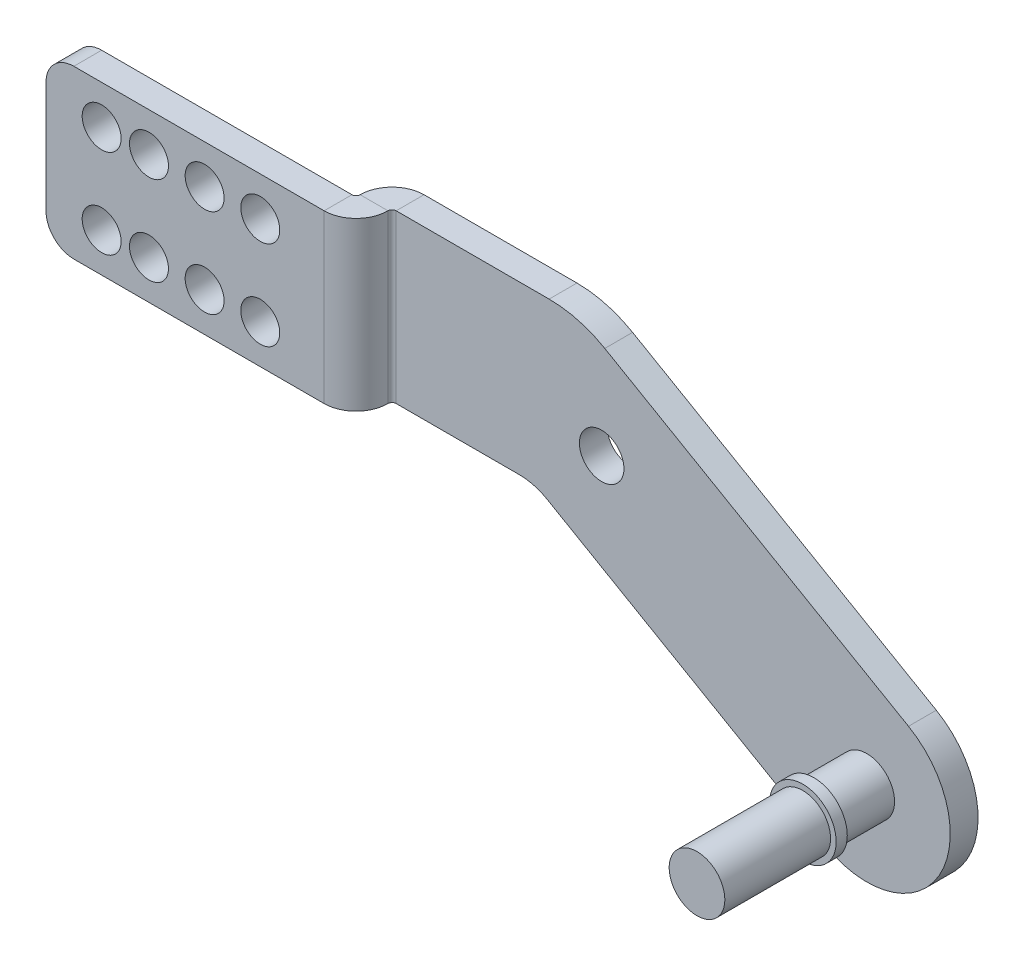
ISO-10303-21;
HEADER;
FILE_DESCRIPTION(('STEP AP214'),'2;1');
FILE_NAME('part.step','',(''),(''),'','','');
FILE_SCHEMA(('AUTOMOTIVE_DESIGN { 1 0 10303 214 1 1 1 1 }'));
ENDSEC;
DATA;
#1=APPLICATION_CONTEXT('core data for automotive mechanical design processes');
#2=APPLICATION_PROTOCOL_DEFINITION('international standard','automotive_design',2000,#1);
#3=PRODUCT_CONTEXT('',#1,'mechanical');
#4=PRODUCT('Part','Part','',(#3));
#5=PRODUCT_RELATED_PRODUCT_CATEGORY('part','',(#4));
#6=PRODUCT_DEFINITION_FORMATION('','',#4);
#7=PRODUCT_DEFINITION_CONTEXT('part definition',#1,'design');
#8=PRODUCT_DEFINITION('design','',#6,#7);
#9=PRODUCT_DEFINITION_SHAPE('','',#8);
#10=(LENGTH_UNIT() NAMED_UNIT(*) SI_UNIT(.MILLI.,.METRE.));
#11=(NAMED_UNIT(*) PLANE_ANGLE_UNIT() SI_UNIT($,.RADIAN.));
#12=(NAMED_UNIT(*) SI_UNIT($,.STERADIAN.) SOLID_ANGLE_UNIT());
#13=UNCERTAINTY_MEASURE_WITH_UNIT(LENGTH_MEASURE(1.E-05),#10,'distance_accuracy_value','');
#14=(GEOMETRIC_REPRESENTATION_CONTEXT(3) GLOBAL_UNCERTAINTY_ASSIGNED_CONTEXT((#13)) GLOBAL_UNIT_ASSIGNED_CONTEXT((#10,
#11,#12)) REPRESENTATION_CONTEXT('',''));
#15=CARTESIAN_POINT('',(0.,0.,0.));
#16=DIRECTION('',(0.,0.,1.));
#17=DIRECTION('',(1.,0.,0.));
#18=AXIS2_PLACEMENT_3D('',#15,#16,#17);
#19=CARTESIAN_POINT('',(1076.1484565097,382.762408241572,5.));
#20=DIRECTION('',(0.,-1.,0.));
#21=DIRECTION('',(1.,0.,0.));
#22=AXIS2_PLACEMENT_3D('',#19,#20,#21);
#23=PLANE('',#22);
#24=DIRECTION('',(-1.,0.,0.));
#25=VECTOR('',#24,1.);
#26=CARTESIAN_POINT('',(1076.1484565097,382.762408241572,0.));
#27=LINE('',#26,#25);
#28=CARTESIAN_POINT('',(1076.1484565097,382.762408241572,0.));
#29=VERTEX_POINT('',#28);
#30=CARTESIAN_POINT('',(1048.67009661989,382.762408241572,7.34061774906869E-07));
#31=VERTEX_POINT('',#30);
#32=EDGE_CURVE('E288',#29,#31,#27,.T.);
#33=ORIENTED_EDGE('',*,*,#32,.T.);
#34=DIRECTION('',(0.,0.,1.));
#35=VECTOR('',#34,1.);
#36=CARTESIAN_POINT('',(1048.67009661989,382.762408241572,5.));
#37=LINE('',#36,#35);
#38=CARTESIAN_POINT('',(1048.67009661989,382.762408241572,5.00000073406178));
#39=VERTEX_POINT('',#38);
#40=EDGE_CURVE('E321',#31,#39,#37,.T.);
#41=ORIENTED_EDGE('',*,*,#40,.T.);
#42=DIRECTION('',(-1.,0.,0.));
#43=VECTOR('',#42,1.);
#44=CARTESIAN_POINT('',(1076.1484565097,382.762408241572,5.));
#45=LINE('',#44,#43);
#46=CARTESIAN_POINT('',(1076.1484565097,382.762408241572,5.));
#47=VERTEX_POINT('',#46);
#48=EDGE_CURVE('E300',#47,#39,#45,.T.);
#49=ORIENTED_EDGE('',*,*,#48,.F.);
#50=DIRECTION('',(0.,0.,-1.));
#51=VECTOR('',#50,1.);
#52=CARTESIAN_POINT('',(1076.1484565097,382.762408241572,5.));
#53=LINE('',#52,#51);
#54=EDGE_CURVE('E301',#47,#29,#53,.T.);
#55=ORIENTED_EDGE('',*,*,#54,.T.);
#56=EDGE_LOOP('',(#33,#41,#49,#55));
#57=FACE_BOUND('',#56,.T.);
#58=ADVANCED_FACE('F16',(#57),#23,.F.);
#59=CARTESIAN_POINT('',(997.221036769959,352.762408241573,5.));
#60=DIRECTION('',(0.,1.,0.));
#61=DIRECTION('',(0.,0.,1.));
#62=AXIS2_PLACEMENT_3D('',#59,#60,#61);
#63=PLANE('',#62);
#64=DIRECTION('',(1.,0.,0.));
#65=VECTOR('',#64,1.);
#66=CARTESIAN_POINT('',(997.221036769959,352.762408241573,5.));
#67=LINE('',#66,#65);
#68=CARTESIAN_POINT('',(1048.67009661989,352.762408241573,5.00000036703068));
#69=VERTEX_POINT('',#68);
#70=CARTESIAN_POINT('',(1070.78947266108,352.762408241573,5.));
#71=VERTEX_POINT('',#70);
#72=EDGE_CURVE('E292',#69,#71,#67,.T.);
#73=ORIENTED_EDGE('',*,*,#72,.F.);
#74=DIRECTION('',(0.,0.,-1.));
#75=VECTOR('',#74,1.);
#76=CARTESIAN_POINT('',(1048.67009661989,352.762408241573,5.));
#77=LINE('',#76,#75);
#78=CARTESIAN_POINT('',(1048.67009661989,352.762408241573,0.));
#79=VERTEX_POINT('',#78);
#80=EDGE_CURVE('E327',#69,#79,#77,.T.);
#81=ORIENTED_EDGE('',*,*,#80,.T.);
#82=DIRECTION('',(1.,0.,0.));
#83=VECTOR('',#82,1.);
#84=CARTESIAN_POINT('',(997.221036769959,352.762408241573,0.));
#85=LINE('',#84,#83);
#86=CARTESIAN_POINT('',(1070.78947266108,352.762408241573,0.));
#87=VERTEX_POINT('',#86);
#88=EDGE_CURVE('E277',#79,#87,#85,.T.);
#89=ORIENTED_EDGE('',*,*,#88,.T.);
#90=DIRECTION('',(0.,0.,-1.));
#91=VECTOR('',#90,1.);
#92=CARTESIAN_POINT('',(1070.78947266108,352.762408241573,5.));
#93=LINE('',#92,#91);
#94=EDGE_CURVE('E316',#71,#87,#93,.T.);
#95=ORIENTED_EDGE('',*,*,#94,.F.);
#96=EDGE_LOOP('',(#73,#81,#89,#95));
#97=FACE_BOUND('',#96,.T.);
#98=ADVANCED_FACE('F365',(#97),#63,.F.);
#99=CARTESIAN_POINT('',(997.221036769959,357.762408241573,0.));
#100=DIRECTION('',(0.,0.,1.));
#101=DIRECTION('',(1.,0.,0.));
#102=AXIS2_PLACEMENT_3D('',#99,#100,#101);
#103=PLANE('',#102);
#104=CARTESIAN_POINT('',(1085.58963956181,363.085041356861,0.));
#105=DIRECTION('',(0.,0.,1.));
#106=DIRECTION('',(1.,0.,0.));
#107=AXIS2_PLACEMENT_3D('',#104,#105,#106);
#108=CIRCLE('',#107,4.);
#109=CARTESIAN_POINT('',(1089.58963956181,363.085041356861,0.));
#110=VERTEX_POINT('',#109);
#111=EDGE_CURVE('E271',#110,#110,#108,.T.);
#112=ORIENTED_EDGE('',*,*,#111,.T.);
#113=EDGE_LOOP('',(#112));
#114=FACE_BOUND('',#113,.T.);
#115=ORIENTED_EDGE('',*,*,#88,.F.);
#116=DIRECTION('',(0.,1.,0.));
#117=VECTOR('',#116,1.);
#118=CARTESIAN_POINT('',(1048.67009661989,357.762408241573,0.));
#119=LINE('',#118,#117);
#120=EDGE_CURVE('E324',#79,#31,#119,.T.);
#121=ORIENTED_EDGE('',*,*,#120,.T.);
#122=ORIENTED_EDGE('',*,*,#32,.F.);
#123=CARTESIAN_POINT('',(1076.1484565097,362.762408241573,0.));
#124=DIRECTION('',(0.,0.,1.));
#125=DIRECTION('',(1.,0.,0.));
#126=AXIS2_PLACEMENT_3D('',#123,#124,#125);
#127=CIRCLE('',#126,20.);
#128=CARTESIAN_POINT('',(1086.1484565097,380.082916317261,0.));
#129=VERTEX_POINT('',#128);
#130=EDGE_CURVE('E286',#129,#29,#127,.T.);
#131=ORIENTED_EDGE('',*,*,#130,.F.);
#132=DIRECTION('',(-0.866025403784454,0.499999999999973,0.));
#133=VECTOR('',#132,1.);
#134=CARTESIAN_POINT('',(1140.72103676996,348.575422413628,0.));
#135=LINE('',#134,#133);
#136=CARTESIAN_POINT('',(1140.72103676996,348.575422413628,0.));
#137=VERTEX_POINT('',#136);
#138=EDGE_CURVE('E284',#137,#129,#135,.T.);
#139=ORIENTED_EDGE('',*,*,#138,.F.);
#140=CARTESIAN_POINT('',(1133.22103676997,335.58504135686,0.));
#141=DIRECTION('',(0.,0.,1.));
#142=DIRECTION('',(1.,0.,0.));
#143=AXIS2_PLACEMENT_3D('',#140,#141,#142);
#144=CIRCLE('',#143,14.999999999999);
#145=CARTESIAN_POINT('',(1125.72103676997,322.594660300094,0.));
#146=VERTEX_POINT('',#145);
#147=EDGE_CURVE('E282',#146,#137,#144,.T.);
#148=ORIENTED_EDGE('',*,*,#147,.F.);
#149=DIRECTION('',(0.866025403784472,-0.499999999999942,0.));
#150=VECTOR('',#149,1.);
#151=CARTESIAN_POINT('',(1075.78947266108,351.422662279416,0.));
#152=LINE('',#151,#150);
#153=CARTESIAN_POINT('',(1075.78947266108,351.422662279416,0.));
#154=VERTEX_POINT('',#153);
#155=EDGE_CURVE('E280',#154,#146,#152,.T.);
#156=ORIENTED_EDGE('',*,*,#155,.F.);
#157=CARTESIAN_POINT('',(1070.78947266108,342.762408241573,0.));
#158=DIRECTION('',(0.,0.,-1.));
#159=DIRECTION('',(1.,0.,0.));
#160=AXIS2_PLACEMENT_3D('',#157,#158,#159);
#161=CIRCLE('',#160,10.);
#162=EDGE_CURVE('E278',#87,#154,#161,.T.);
#163=ORIENTED_EDGE('',*,*,#162,.F.);
#164=EDGE_LOOP('',(#115,#121,#122,#131,#139,#148,#156,#163));
#165=FACE_BOUND('',#164,.T.);
#166=ADVANCED_FACE('F359',(#114,#165),#103,.F.);
#167=CARTESIAN_POINT('',(1133.22103676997,335.58504135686,16.5));
#168=DIRECTION('',(0.,0.,1.));
#169=DIRECTION('',(1.,0.,0.));
#170=AXIS2_PLACEMENT_3D('',#167,#168,#169);
#171=PLANE('',#170);
#172=CARTESIAN_POINT('',(1133.22103676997,335.58504135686,16.5));
#173=DIRECTION('',(0.,0.,1.));
#174=DIRECTION('',(1.,0.,0.));
#175=AXIS2_PLACEMENT_3D('',#172,#173,#174);
#176=CIRCLE('',#175,5.99999999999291);
#177=CARTESIAN_POINT('',(1139.22103676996,335.58504135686,16.5));
#178=VERTEX_POINT('',#177);
#179=EDGE_CURVE('E262',#178,#178,#176,.T.);
#180=ORIENTED_EDGE('',*,*,#179,.T.);
#181=EDGE_LOOP('',(#180));
#182=FACE_BOUND('',#181,.T.);
#183=CARTESIAN_POINT('',(1133.22103676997,335.58504135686,16.5));
#184=DIRECTION('',(0.,0.,1.));
#185=DIRECTION('',(1.,0.,0.));
#186=AXIS2_PLACEMENT_3D('',#183,#184,#185);
#187=CIRCLE('',#186,4.99999999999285);
#188=CARTESIAN_POINT('',(1138.22103676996,335.58504135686,16.5));
#189=VERTEX_POINT('',#188);
#190=EDGE_CURVE('E253',#189,#189,#187,.T.);
#191=ORIENTED_EDGE('',*,*,#190,.F.);
#192=EDGE_LOOP('',(#191));
#193=FACE_BOUND('',#192,.T.);
#194=ADVANCED_FACE('F403',(#182,#193),#171,.T.);
#195=CARTESIAN_POINT('',(997.221036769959,357.762408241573,5.));
#196=DIRECTION('',(0.,0.,1.));
#197=DIRECTION('',(1.,0.,0.));
#198=AXIS2_PLACEMENT_3D('',#195,#196,#197);
#199=PLANE('',#198);
#200=DIRECTION('',(0.,1.,0.));
#201=VECTOR('',#200,1.);
#202=CARTESIAN_POINT('',(1048.67009661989,357.762408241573,5.));
#203=LINE('',#202,#201);
#204=EDGE_CURVE('E319',#69,#39,#203,.T.);
#205=ORIENTED_EDGE('',*,*,#204,.F.);
#206=ORIENTED_EDGE('',*,*,#72,.T.);
#207=CARTESIAN_POINT('',(1070.78947266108,342.762408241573,5.));
#208=DIRECTION('',(0.,0.,-1.));
#209=DIRECTION('',(1.,0.,0.));
#210=AXIS2_PLACEMENT_3D('',#207,#208,#209);
#211=CIRCLE('',#210,10.);
#212=CARTESIAN_POINT('',(1075.78947266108,351.422662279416,5.));
#213=VERTEX_POINT('',#212);
#214=EDGE_CURVE('E289',#71,#213,#211,.T.);
#215=ORIENTED_EDGE('',*,*,#214,.T.);
#216=DIRECTION('',(0.866025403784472,-0.499999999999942,0.));
#217=VECTOR('',#216,1.);
#218=CARTESIAN_POINT('',(1075.78947266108,351.422662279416,5.));
#219=LINE('',#218,#217);
#220=CARTESIAN_POINT('',(1125.72103676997,322.594660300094,5.));
#221=VERTEX_POINT('',#220);
#222=EDGE_CURVE('E291',#213,#221,#219,.T.);
#223=ORIENTED_EDGE('',*,*,#222,.T.);
#224=CARTESIAN_POINT('',(1133.22103676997,335.58504135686,5.));
#225=DIRECTION('',(0.,0.,1.));
#226=DIRECTION('',(1.,0.,0.));
#227=AXIS2_PLACEMENT_3D('',#224,#225,#226);
#228=CIRCLE('',#227,14.999999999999);
#229=CARTESIAN_POINT('',(1140.72103676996,348.575422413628,5.));
#230=VERTEX_POINT('',#229);
#231=EDGE_CURVE('E294',#221,#230,#228,.T.);
#232=ORIENTED_EDGE('',*,*,#231,.T.);
#233=DIRECTION('',(-0.866025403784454,0.499999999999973,0.));
#234=VECTOR('',#233,1.);
#235=CARTESIAN_POINT('',(1140.72103676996,348.575422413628,5.));
#236=LINE('',#235,#234);
#237=CARTESIAN_POINT('',(1086.1484565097,380.082916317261,5.));
#238=VERTEX_POINT('',#237);
#239=EDGE_CURVE('E296',#230,#238,#236,.T.);
#240=ORIENTED_EDGE('',*,*,#239,.T.);
#241=CARTESIAN_POINT('',(1076.1484565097,362.762408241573,5.));
#242=DIRECTION('',(0.,0.,1.));
#243=DIRECTION('',(1.,0.,0.));
#244=AXIS2_PLACEMENT_3D('',#241,#242,#243);
#245=CIRCLE('',#244,20.);
#246=EDGE_CURVE('E298',#238,#47,#245,.T.);
#247=ORIENTED_EDGE('',*,*,#246,.T.);
#248=ORIENTED_EDGE('',*,*,#48,.T.);
#249=EDGE_LOOP('',(#205,#206,#215,#223,#232,#240,#247,#248));
#250=FACE_BOUND('',#249,.T.);
#251=CARTESIAN_POINT('',(1085.58963956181,363.085041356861,5.));
#252=DIRECTION('',(0.,0.,1.));
#253=DIRECTION('',(1.,0.,0.));
#254=AXIS2_PLACEMENT_3D('',#251,#252,#253);
#255=CIRCLE('',#254,4.);
#256=CARTESIAN_POINT('',(1089.58963956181,363.085041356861,5.));
#257=VERTEX_POINT('',#256);
#258=EDGE_CURVE('E274',#257,#257,#255,.T.);
#259=ORIENTED_EDGE('',*,*,#258,.F.);
#260=EDGE_LOOP('',(#259));
#261=FACE_BOUND('',#260,.T.);
#262=CARTESIAN_POINT('',(1133.22103676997,335.58504135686,5.));
#263=DIRECTION('',(0.,0.,1.));
#264=DIRECTION('',(1.,0.,0.));
#265=AXIS2_PLACEMENT_3D('',#262,#263,#264);
#266=CIRCLE('',#265,4.99999999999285);
#267=CARTESIAN_POINT('',(1138.22103676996,335.58504135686,5.));
#268=VERTEX_POINT('',#267);
#269=EDGE_CURVE('E265',#268,#268,#266,.T.);
#270=ORIENTED_EDGE('',*,*,#269,.F.);
#271=EDGE_LOOP('',(#270));
#272=FACE_BOUND('',#271,.T.);
#273=ADVANCED_FACE('F18',(#250,#261,#272),#199,.T.);
#274=CARTESIAN_POINT('',(1070.78947266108,342.762408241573,5.));
#275=DIRECTION('',(0.,0.,-1.));
#276=DIRECTION('',(-1.,0.,0.));
#277=AXIS2_PLACEMENT_3D('',#274,#275,#276);
#278=CYLINDRICAL_SURFACE('',#277,10.);
#279=ORIENTED_EDGE('',*,*,#162,.T.);
#280=DIRECTION('',(0.,0.,-1.));
#281=VECTOR('',#280,1.);
#282=CARTESIAN_POINT('',(1075.78947266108,351.422662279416,5.));
#283=LINE('',#282,#281);
#284=EDGE_CURVE('E313',#213,#154,#283,.T.);
#285=ORIENTED_EDGE('',*,*,#284,.F.);
#286=ORIENTED_EDGE('',*,*,#214,.F.);
#287=ORIENTED_EDGE('',*,*,#94,.T.);
#288=EDGE_LOOP('',(#279,#285,#286,#287));
#289=FACE_BOUND('',#288,.T.);
#290=ADVANCED_FACE('F394',(#289),#278,.F.);
#291=CARTESIAN_POINT('',(1075.78947266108,351.422662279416,5.));
#292=DIRECTION('',(0.499999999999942,0.866025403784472,0.));
#293=DIRECTION('',(-0.866025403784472,0.499999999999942,0.));
#294=AXIS2_PLACEMENT_3D('',#291,#292,#293);
#295=PLANE('',#294);
#296=ORIENTED_EDGE('',*,*,#155,.T.);
#297=DIRECTION('',(0.,0.,-1.));
#298=VECTOR('',#297,1.);
#299=CARTESIAN_POINT('',(1125.72103676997,322.594660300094,5.));
#300=LINE('',#299,#298);
#301=EDGE_CURVE('E310',#221,#146,#300,.T.);
#302=ORIENTED_EDGE('',*,*,#301,.F.);
#303=ORIENTED_EDGE('',*,*,#222,.F.);
#304=ORIENTED_EDGE('',*,*,#284,.T.);
#305=EDGE_LOOP('',(#296,#302,#303,#304));
#306=FACE_BOUND('',#305,.T.);
#307=ADVANCED_FACE('F390',(#306),#295,.F.);
#308=CARTESIAN_POINT('',(1133.22103676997,335.58504135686,5.));
#309=DIRECTION('',(0.,0.,-1.));
#310=DIRECTION('',(-1.,0.,0.));
#311=AXIS2_PLACEMENT_3D('',#308,#309,#310);
#312=CYLINDRICAL_SURFACE('',#311,14.999999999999);
#313=ORIENTED_EDGE('',*,*,#147,.T.);
#314=DIRECTION('',(0.,0.,-1.));
#315=VECTOR('',#314,1.);
#316=CARTESIAN_POINT('',(1140.72103676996,348.575422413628,5.));
#317=LINE('',#316,#315);
#318=EDGE_CURVE('E307',#230,#137,#317,.T.);
#319=ORIENTED_EDGE('',*,*,#318,.F.);
#320=ORIENTED_EDGE('',*,*,#231,.F.);
#321=ORIENTED_EDGE('',*,*,#301,.T.);
#322=EDGE_LOOP('',(#313,#319,#320,#321));
#323=FACE_BOUND('',#322,.T.);
#324=ADVANCED_FACE('F386',(#323),#312,.T.);
#325=CARTESIAN_POINT('',(1140.72103676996,348.575422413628,5.));
#326=DIRECTION('',(-0.499999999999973,-0.866025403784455,0.));
#327=DIRECTION('',(0.866025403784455,-0.499999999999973,0.));
#328=AXIS2_PLACEMENT_3D('',#325,#326,#327);
#329=PLANE('',#328);
#330=ORIENTED_EDGE('',*,*,#138,.T.);
#331=DIRECTION('',(0.,0.,-1.));
#332=VECTOR('',#331,1.);
#333=CARTESIAN_POINT('',(1086.1484565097,380.082916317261,5.));
#334=LINE('',#333,#332);
#335=EDGE_CURVE('E304',#238,#129,#334,.T.);
#336=ORIENTED_EDGE('',*,*,#335,.F.);
#337=ORIENTED_EDGE('',*,*,#239,.F.);
#338=ORIENTED_EDGE('',*,*,#318,.T.);
#339=EDGE_LOOP('',(#330,#336,#337,#338));
#340=FACE_BOUND('',#339,.T.);
#341=ADVANCED_FACE('F382',(#340),#329,.F.);
#342=CARTESIAN_POINT('',(1076.1484565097,362.762408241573,5.));
#343=DIRECTION('',(0.,0.,-1.));
#344=DIRECTION('',(-1.,0.,0.));
#345=AXIS2_PLACEMENT_3D('',#342,#343,#344);
#346=CYLINDRICAL_SURFACE('',#345,20.);
#347=ORIENTED_EDGE('',*,*,#130,.T.);
#348=ORIENTED_EDGE('',*,*,#54,.F.);
#349=ORIENTED_EDGE('',*,*,#246,.F.);
#350=ORIENTED_EDGE('',*,*,#335,.T.);
#351=EDGE_LOOP('',(#347,#348,#349,#350));
#352=FACE_BOUND('',#351,.T.);
#353=ADVANCED_FACE('F378',(#352),#346,.T.);
#354=CARTESIAN_POINT('',(1085.58963956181,363.085041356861,5.));
#355=DIRECTION('',(0.,0.,-1.));
#356=DIRECTION('',(-1.,0.,0.));
#357=AXIS2_PLACEMENT_3D('',#354,#355,#356);
#358=CYLINDRICAL_SURFACE('',#357,4.);
#359=ORIENTED_EDGE('',*,*,#258,.T.);
#360=EDGE_LOOP('',(#359));
#361=FACE_BOUND('',#360,.T.);
#362=ORIENTED_EDGE('',*,*,#111,.F.);
#363=EDGE_LOOP('',(#362));
#364=FACE_BOUND('',#363,.T.);
#365=ADVANCED_FACE('F419',(#361,#364),#358,.F.);
#366=CARTESIAN_POINT('',(1133.22103676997,335.58504135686,14.5));
#367=DIRECTION('',(0.,0.,-1.));
#368=DIRECTION('',(-1.,0.,0.));
#369=AXIS2_PLACEMENT_3D('',#366,#367,#368);
#370=CYLINDRICAL_SURFACE('',#369,4.99999999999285);
#371=CARTESIAN_POINT('',(1133.22103676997,335.58504135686,14.5));
#372=DIRECTION('',(0.,0.,1.));
#373=DIRECTION('',(1.,0.,0.));
#374=AXIS2_PLACEMENT_3D('',#371,#372,#373);
#375=CIRCLE('',#374,4.99999999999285);
#376=CARTESIAN_POINT('',(1138.22103676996,335.58504135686,14.5));
#377=VERTEX_POINT('',#376);
#378=EDGE_CURVE('E268',#377,#377,#375,.T.);
#379=ORIENTED_EDGE('',*,*,#378,.F.);
#380=EDGE_LOOP('',(#379));
#381=FACE_BOUND('',#380,.T.);
#382=ORIENTED_EDGE('',*,*,#269,.T.);
#383=EDGE_LOOP('',(#382));
#384=FACE_BOUND('',#383,.T.);
#385=ADVANCED_FACE('F421',(#381,#384),#370,.T.);
#386=CARTESIAN_POINT('',(1133.22103676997,335.58504135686,14.5));
#387=DIRECTION('',(0.,0.,1.));
#388=DIRECTION('',(1.,0.,0.));
#389=AXIS2_PLACEMENT_3D('',#386,#387,#388);
#390=PLANE('',#389);
#391=CARTESIAN_POINT('',(1133.22103676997,335.58504135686,14.5));
#392=DIRECTION('',(0.,0.,1.));
#393=DIRECTION('',(1.,0.,0.));
#394=AXIS2_PLACEMENT_3D('',#391,#392,#393);
#395=CIRCLE('',#394,5.99999999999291);
#396=CARTESIAN_POINT('',(1139.22103676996,335.58504135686,14.5));
#397=VERTEX_POINT('',#396);
#398=EDGE_CURVE('E259',#397,#397,#395,.T.);
#399=ORIENTED_EDGE('',*,*,#398,.F.);
#400=EDGE_LOOP('',(#399));
#401=FACE_BOUND('',#400,.T.);
#402=ORIENTED_EDGE('',*,*,#378,.T.);
#403=EDGE_LOOP('',(#402));
#404=FACE_BOUND('',#403,.T.);
#405=ADVANCED_FACE('F428',(#401,#404),#390,.F.);
#406=CARTESIAN_POINT('',(1133.22103676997,335.58504135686,16.5));
#407=DIRECTION('',(0.,0.,-1.));
#408=DIRECTION('',(-1.,0.,0.));
#409=AXIS2_PLACEMENT_3D('',#406,#407,#408);
#410=CYLINDRICAL_SURFACE('',#409,5.99999999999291);
#411=ORIENTED_EDGE('',*,*,#179,.F.);
#412=EDGE_LOOP('',(#411));
#413=FACE_BOUND('',#412,.T.);
#414=ORIENTED_EDGE('',*,*,#398,.T.);
#415=EDGE_LOOP('',(#414));
#416=FACE_BOUND('',#415,.T.);
#417=ADVANCED_FACE('F477',(#413,#416),#410,.T.);
#418=CARTESIAN_POINT('',(1133.22103676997,335.58504135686,35.5));
#419=DIRECTION('',(0.,0.,-1.));
#420=DIRECTION('',(-1.,0.,0.));
#421=AXIS2_PLACEMENT_3D('',#418,#419,#420);
#422=CYLINDRICAL_SURFACE('',#421,4.99999999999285);
#423=CARTESIAN_POINT('',(1133.22103676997,335.58504135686,35.5));
#424=DIRECTION('',(0.,0.,1.));
#425=DIRECTION('',(1.,0.,0.));
#426=AXIS2_PLACEMENT_3D('',#423,#424,#425);
#427=CIRCLE('',#426,4.99999999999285);
#428=CARTESIAN_POINT('',(1138.22103676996,335.58504135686,35.5));
#429=VERTEX_POINT('',#428);
#430=EDGE_CURVE('E256',#429,#429,#427,.T.);
#431=ORIENTED_EDGE('',*,*,#430,.F.);
#432=EDGE_LOOP('',(#431));
#433=FACE_BOUND('',#432,.T.);
#434=ORIENTED_EDGE('',*,*,#190,.T.);
#435=EDGE_LOOP('',(#434));
#436=FACE_BOUND('',#435,.T.);
#437=ADVANCED_FACE('F488',(#433,#436),#422,.T.);
#438=CARTESIAN_POINT('',(1133.22103676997,335.58504135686,35.5));
#439=DIRECTION('',(0.,0.,1.));
#440=DIRECTION('',(1.,0.,0.));
#441=AXIS2_PLACEMENT_3D('',#438,#439,#440);
#442=PLANE('',#441);
#443=ORIENTED_EDGE('',*,*,#430,.T.);
#444=EDGE_LOOP('',(#443));
#445=FACE_BOUND('',#444,.T.);
#446=ADVANCED_FACE('F498',(#445),#442,.T.);
#447=CARTESIAN_POINT('',(1048.67009661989,352.762408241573,5.73659926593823));
#448=DIRECTION('',(0.,1.,0.));
#449=DIRECTION('',(0.,0.,1.));
#450=AXIS2_PLACEMENT_3D('',#447,#448,#449);
#451=PLANE('',#450);
#452=DIRECTION('',(-1.,0.,0.));
#453=VECTOR('',#452,1.);
#454=CARTESIAN_POINT('',(1047.93349661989,352.762408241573,5.73660000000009));
#455=LINE('',#454,#453);
#456=CARTESIAN_POINT('',(1047.9334966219,352.762408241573,5.7366));
#457=VERTEX_POINT('',#456);
#458=CARTESIAN_POINT('',(1042.93349661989,352.762408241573,5.73660000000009));
#459=VERTEX_POINT('',#458);
#460=EDGE_CURVE('E11',#457,#459,#455,.T.);
#461=ORIENTED_EDGE('',*,*,#460,.T.);
#462=CARTESIAN_POINT('',(1048.67009661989,352.762408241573,5.7366));
#463=DIRECTION('',(0.,-1.,0.));
#464=DIRECTION('',(0.,0.,-1.));
#465=AXIS2_PLACEMENT_3D('',#462,#463,#464);
#466=CIRCLE('',#465,5.73659926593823);
#467=EDGE_CURVE('E38',#459,#79,#466,.T.);
#468=ORIENTED_EDGE('',*,*,#467,.T.);
#469=ORIENTED_EDGE('',*,*,#80,.F.);
#470=CARTESIAN_POINT('',(1048.67009661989,352.762408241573,5.73659926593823));
#471=DIRECTION('',(0.,-1.,0.));
#472=DIRECTION('',(0.,0.,-1.));
#473=AXIS2_PLACEMENT_3D('',#470,#471,#472);
#474=CIRCLE('',#473,0.736598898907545);
#475=EDGE_CURVE('E247',#457,#69,#474,.T.);
#476=ORIENTED_EDGE('',*,*,#475,.F.);
#477=EDGE_LOOP('',(#461,#468,#469,#476));
#478=FACE_BOUND('',#477,.T.);
#479=ADVANCED_FACE('F367',(#478),#451,.F.);
#480=CARTESIAN_POINT('',(1048.67009661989,382.762408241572,5.73659926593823));
#481=DIRECTION('',(0.,-1.,0.));
#482=DIRECTION('',(0.,0.,-1.));
#483=AXIS2_PLACEMENT_3D('',#480,#481,#482);
#484=PLANE('',#483);
#485=CARTESIAN_POINT('',(1048.67009661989,382.762408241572,5.7366));
#486=DIRECTION('',(0.,-1.,0.));
#487=DIRECTION('',(0.,0.,-1.));
#488=AXIS2_PLACEMENT_3D('',#485,#486,#487);
#489=CIRCLE('',#488,5.73659926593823);
#490=CARTESIAN_POINT('',(1042.93349662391,382.762408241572,5.73660000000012));
#491=VERTEX_POINT('',#490);
#492=EDGE_CURVE('E244',#31,#491,#489,.F.);
#493=ORIENTED_EDGE('',*,*,#492,.T.);
#494=DIRECTION('',(1.,0.,0.));
#495=VECTOR('',#494,1.);
#496=CARTESIAN_POINT('',(1047.93349661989,382.762408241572,5.73660000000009));
#497=LINE('',#496,#495);
#498=CARTESIAN_POINT('',(1047.93349662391,382.762408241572,5.73660000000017));
#499=VERTEX_POINT('',#498);
#500=EDGE_CURVE('E338',#491,#499,#497,.T.);
#501=ORIENTED_EDGE('',*,*,#500,.T.);
#502=CARTESIAN_POINT('',(1048.67009661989,382.762408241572,5.73659926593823));
#503=DIRECTION('',(0.,1.,0.));
#504=DIRECTION('',(0.,0.,1.));
#505=AXIS2_PLACEMENT_3D('',#502,#503,#504);
#506=CIRCLE('',#505,0.736598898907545);
#507=EDGE_CURVE('E250',#39,#499,#506,.T.);
#508=ORIENTED_EDGE('',*,*,#507,.F.);
#509=ORIENTED_EDGE('',*,*,#40,.F.);
#510=EDGE_LOOP('',(#493,#501,#508,#509));
#511=FACE_BOUND('',#510,.T.);
#512=ADVANCED_FACE('F350',(#511),#484,.F.);
#513=CARTESIAN_POINT('',(1048.67009661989,398.598222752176,5.7366));
#514=DIRECTION('',(0.,-1.,0.));
#515=DIRECTION('',(0.,0.,-1.));
#516=AXIS2_PLACEMENT_3D('',#513,#514,#515);
#517=CYLINDRICAL_SURFACE('',#516,0.736599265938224);
#518=ORIENTED_EDGE('',*,*,#204,.T.);
#519=ORIENTED_EDGE('',*,*,#507,.T.);
#520=DIRECTION('',(0.,1.,0.));
#521=VECTOR('',#520,1.);
#522=CARTESIAN_POINT('',(1047.93349661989,357.762408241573,5.73660000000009));
#523=LINE('',#522,#521);
#524=EDGE_CURVE('E330',#457,#499,#523,.T.);
#525=ORIENTED_EDGE('',*,*,#524,.F.);
#526=ORIENTED_EDGE('',*,*,#475,.T.);
#527=EDGE_LOOP('',(#518,#519,#525,#526));
#528=FACE_BOUND('',#527,.T.);
#529=ADVANCED_FACE('F371',(#528),#517,.F.);
#530=CARTESIAN_POINT('',(1048.67009661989,398.598222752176,5.7366));
#531=DIRECTION('',(0.,-1.,0.));
#532=DIRECTION('',(0.,0.,-1.));
#533=AXIS2_PLACEMENT_3D('',#530,#531,#532);
#534=CYLINDRICAL_SURFACE('',#533,5.73659926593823);
#535=ORIENTED_EDGE('',*,*,#120,.F.);
#536=ORIENTED_EDGE('',*,*,#467,.F.);
#537=DIRECTION('',(0.,1.,0.));
#538=VECTOR('',#537,1.);
#539=CARTESIAN_POINT('',(1042.93349661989,357.762408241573,5.73660000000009));
#540=LINE('',#539,#538);
#541=EDGE_CURVE('E24',#459,#491,#540,.T.);
#542=ORIENTED_EDGE('',*,*,#541,.T.);
#543=ORIENTED_EDGE('',*,*,#492,.F.);
#544=EDGE_LOOP('',(#535,#536,#542,#543));
#545=FACE_BOUND('',#544,.T.);
#546=ADVANCED_FACE('F343',(#545),#534,.T.);
#547=CARTESIAN_POINT('',(1042.19689661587,352.762408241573,5.73660000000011));
#548=DIRECTION('',(0.,-1.,0.));
#549=DIRECTION('',(0.,0.,-1.));
#550=AXIS2_PLACEMENT_3D('',#547,#548,#549);
#551=PLANE('',#550);
#552=DIRECTION('',(0.,0.,-1.));
#553=VECTOR('',#552,1.);
#554=CARTESIAN_POINT('',(1042.19689661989,352.762408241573,11.4732));
#555=LINE('',#554,#553);
#556=CARTESIAN_POINT('',(1042.19689735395,352.762408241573,11.4732000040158));
#557=VERTEX_POINT('',#556);
#558=CARTESIAN_POINT('',(1042.19689661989,352.762408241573,6.47320000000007));
#559=VERTEX_POINT('',#558);
#560=EDGE_CURVE('E136',#557,#559,#555,.T.);
#561=ORIENTED_EDGE('',*,*,#560,.T.);
#562=CARTESIAN_POINT('',(1042.19689661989,352.762408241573,5.73660000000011));
#563=DIRECTION('',(0.,-1.,0.));
#564=DIRECTION('',(0.,0.,-1.));
#565=AXIS2_PLACEMENT_3D('',#562,#563,#564);
#566=CIRCLE('',#565,0.736600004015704);
#567=EDGE_CURVE('E31',#559,#459,#566,.F.);
#568=ORIENTED_EDGE('',*,*,#567,.T.);
#569=ORIENTED_EDGE('',*,*,#460,.F.);
#570=CARTESIAN_POINT('',(1042.19689661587,352.762408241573,5.73660000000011));
#571=DIRECTION('',(0.,1.,0.));
#572=DIRECTION('',(0.,0.,1.));
#573=AXIS2_PLACEMENT_3D('',#570,#571,#572);
#574=CIRCLE('',#573,5.73660000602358);
#575=EDGE_CURVE('E237',#557,#457,#574,.T.);
#576=ORIENTED_EDGE('',*,*,#575,.F.);
#577=EDGE_LOOP('',(#561,#568,#569,#576));
#578=FACE_BOUND('',#577,.T.);
#579=ADVANCED_FACE('F540',(#578),#551,.T.);
#580=CARTESIAN_POINT('',(1042.19689661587,382.762408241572,5.73660000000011));
#581=DIRECTION('',(0.,1.,0.));
#582=DIRECTION('',(0.,0.,1.));
#583=AXIS2_PLACEMENT_3D('',#580,#581,#582);
#584=PLANE('',#583);
#585=CARTESIAN_POINT('',(1042.19689661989,382.762408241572,5.73660000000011));
#586=DIRECTION('',(0.,-1.,0.));
#587=DIRECTION('',(0.,0.,-1.));
#588=AXIS2_PLACEMENT_3D('',#585,#586,#587);
#589=CIRCLE('',#588,0.736600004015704);
#590=CARTESIAN_POINT('',(1042.19689661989,382.762408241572,6.47320000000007));
#591=VERTEX_POINT('',#590);
#592=EDGE_CURVE('E234',#491,#591,#589,.T.);
#593=ORIENTED_EDGE('',*,*,#592,.T.);
#594=DIRECTION('',(0.,0.,1.));
#595=VECTOR('',#594,1.);
#596=CARTESIAN_POINT('',(1042.19689661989,382.762408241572,11.4732));
#597=LINE('',#596,#595);
#598=CARTESIAN_POINT('',(1042.19689661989,382.762408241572,11.4732));
#599=VERTEX_POINT('',#598);
#600=EDGE_CURVE('E226',#591,#599,#597,.T.);
#601=ORIENTED_EDGE('',*,*,#600,.T.);
#602=CARTESIAN_POINT('',(1042.19689661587,382.762408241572,5.73660000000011));
#603=DIRECTION('',(0.,-1.,0.));
#604=DIRECTION('',(0.,0.,-1.));
#605=AXIS2_PLACEMENT_3D('',#602,#603,#604);
#606=CIRCLE('',#605,5.73660000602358);
#607=EDGE_CURVE('E240',#499,#599,#606,.T.);
#608=ORIENTED_EDGE('',*,*,#607,.F.);
#609=ORIENTED_EDGE('',*,*,#500,.F.);
#610=EDGE_LOOP('',(#593,#601,#608,#609));
#611=FACE_BOUND('',#610,.T.);
#612=ADVANCED_FACE('F549',(#611),#584,.T.);
#613=CARTESIAN_POINT('',(1042.19689661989,398.598222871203,5.73660000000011));
#614=DIRECTION('',(0.,-1.,0.));
#615=DIRECTION('',(0.,0.,-1.));
#616=AXIS2_PLACEMENT_3D('',#613,#614,#615);
#617=CYLINDRICAL_SURFACE('',#616,5.7366000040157);
#618=ORIENTED_EDGE('',*,*,#524,.T.);
#619=ORIENTED_EDGE('',*,*,#607,.T.);
#620=DIRECTION('',(0.,1.,0.));
#621=VECTOR('',#620,1.);
#622=CARTESIAN_POINT('',(1042.19689661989,357.762408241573,11.4732));
#623=LINE('',#622,#621);
#624=EDGE_CURVE('E139',#557,#599,#623,.T.);
#625=ORIENTED_EDGE('',*,*,#624,.F.);
#626=ORIENTED_EDGE('',*,*,#575,.T.);
#627=EDGE_LOOP('',(#618,#619,#625,#626));
#628=FACE_BOUND('',#627,.T.);
#629=ADVANCED_FACE('F551',(#628),#617,.T.);
#630=CARTESIAN_POINT('',(1042.19689661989,398.598222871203,5.73660000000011));
#631=DIRECTION('',(0.,-1.,0.));
#632=DIRECTION('',(0.,0.,-1.));
#633=AXIS2_PLACEMENT_3D('',#630,#631,#632);
#634=CYLINDRICAL_SURFACE('',#633,0.736600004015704);
#635=ORIENTED_EDGE('',*,*,#541,.F.);
#636=ORIENTED_EDGE('',*,*,#567,.F.);
#637=DIRECTION('',(0.,1.,0.));
#638=VECTOR('',#637,1.);
#639=CARTESIAN_POINT('',(1042.19689661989,357.762408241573,6.47320000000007));
#640=LINE('',#639,#638);
#641=EDGE_CURVE('E229',#559,#591,#640,.T.);
#642=ORIENTED_EDGE('',*,*,#641,.T.);
#643=ORIENTED_EDGE('',*,*,#592,.F.);
#644=EDGE_LOOP('',(#635,#636,#642,#643));
#645=FACE_BOUND('',#644,.T.);
#646=ADVANCED_FACE('F346',(#645),#634,.F.);
#647=CARTESIAN_POINT('',(997.221036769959,357.762408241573,11.4732));
#648=DIRECTION('',(0.,0.,-1.));
#649=DIRECTION('',(-1.,0.,0.));
#650=AXIS2_PLACEMENT_3D('',#647,#648,#649);
#651=CYLINDRICAL_SURFACE('',#650,5.);
#652=CARTESIAN_POINT('',(997.221036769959,357.762408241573,6.47319999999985));
#653=DIRECTION('',(0.,0.,1.));
#654=DIRECTION('',(1.,0.,0.));
#655=AXIS2_PLACEMENT_3D('',#652,#653,#654);
#656=CIRCLE('',#655,5.);
#657=CARTESIAN_POINT('',(992.221036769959,357.762408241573,6.47319999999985));
#658=VERTEX_POINT('',#657);
#659=CARTESIAN_POINT('',(997.221036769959,352.762408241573,6.47319999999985));
#660=VERTEX_POINT('',#659);
#661=EDGE_CURVE('E154',#658,#660,#656,.T.);
#662=ORIENTED_EDGE('',*,*,#661,.T.);
#663=DIRECTION('',(0.,0.,-1.));
#664=VECTOR('',#663,1.);
#665=CARTESIAN_POINT('',(997.221036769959,352.762408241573,11.4732));
#666=LINE('',#665,#664);
#667=CARTESIAN_POINT('',(997.221036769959,352.762408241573,11.4732));
#668=VERTEX_POINT('',#667);
#669=EDGE_CURVE('E134',#668,#660,#666,.T.);
#670=ORIENTED_EDGE('',*,*,#669,.F.);
#671=CARTESIAN_POINT('',(997.221036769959,357.762408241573,11.4732));
#672=DIRECTION('',(0.,0.,1.));
#673=DIRECTION('',(1.,0.,0.));
#674=AXIS2_PLACEMENT_3D('',#671,#672,#673);
#675=CIRCLE('',#674,5.);
#676=CARTESIAN_POINT('',(992.221036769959,357.762408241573,11.4732));
#677=VERTEX_POINT('',#676);
#678=EDGE_CURVE('E143',#677,#668,#675,.T.);
#679=ORIENTED_EDGE('',*,*,#678,.F.);
#680=DIRECTION('',(0.,0.,-1.));
#681=VECTOR('',#680,1.);
#682=CARTESIAN_POINT('',(992.221036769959,357.762408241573,11.4732));
#683=LINE('',#682,#681);
#684=EDGE_CURVE('E223',#677,#658,#683,.T.);
#685=ORIENTED_EDGE('',*,*,#684,.T.);
#686=EDGE_LOOP('',(#662,#670,#679,#685));
#687=FACE_BOUND('',#686,.T.);
#688=ADVANCED_FACE('F152',(#687),#651,.T.);
#689=CARTESIAN_POINT('',(992.221036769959,377.762408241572,11.4732));
#690=DIRECTION('',(1.,0.,0.));
#691=DIRECTION('',(0.,0.,-1.));
#692=AXIS2_PLACEMENT_3D('',#689,#690,#691);
#693=PLANE('',#692);
#694=DIRECTION('',(0.,-1.,0.));
#695=VECTOR('',#694,1.);
#696=CARTESIAN_POINT('',(992.221036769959,377.762408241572,6.47319999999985));
#697=LINE('',#696,#695);
#698=CARTESIAN_POINT('',(992.221036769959,377.762408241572,6.47319999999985));
#699=VERTEX_POINT('',#698);
#700=EDGE_CURVE('E221',#699,#658,#697,.T.);
#701=ORIENTED_EDGE('',*,*,#700,.T.);
#702=ORIENTED_EDGE('',*,*,#684,.F.);
#703=DIRECTION('',(0.,-1.,0.));
#704=VECTOR('',#703,1.);
#705=CARTESIAN_POINT('',(992.221036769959,377.762408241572,11.4732));
#706=LINE('',#705,#704);
#707=CARTESIAN_POINT('',(992.221036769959,377.762408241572,11.4732));
#708=VERTEX_POINT('',#707);
#709=EDGE_CURVE('E146',#708,#677,#706,.T.);
#710=ORIENTED_EDGE('',*,*,#709,.F.);
#711=DIRECTION('',(0.,0.,-1.));
#712=VECTOR('',#711,1.);
#713=CARTESIAN_POINT('',(992.221036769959,377.762408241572,11.4732));
#714=LINE('',#713,#712);
#715=EDGE_CURVE('E218',#708,#699,#714,.T.);
#716=ORIENTED_EDGE('',*,*,#715,.T.);
#717=EDGE_LOOP('',(#701,#702,#710,#716));
#718=FACE_BOUND('',#717,.T.);
#719=ADVANCED_FACE('F584',(#718),#693,.F.);
#720=CARTESIAN_POINT('',(997.221036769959,377.762408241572,11.4732));
#721=DIRECTION('',(0.,0.,-1.));
#722=DIRECTION('',(-1.,0.,0.));
#723=AXIS2_PLACEMENT_3D('',#720,#721,#722);
#724=CYLINDRICAL_SURFACE('',#723,5.);
#725=CARTESIAN_POINT('',(997.221036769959,377.762408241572,6.47319999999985));
#726=DIRECTION('',(0.,0.,1.));
#727=DIRECTION('',(1.,0.,0.));
#728=AXIS2_PLACEMENT_3D('',#725,#726,#727);
#729=CIRCLE('',#728,5.);
#730=CARTESIAN_POINT('',(997.221036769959,382.762408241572,6.47319999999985));
#731=VERTEX_POINT('',#730);
#732=EDGE_CURVE('E216',#731,#699,#729,.T.);
#733=ORIENTED_EDGE('',*,*,#732,.T.);
#734=ORIENTED_EDGE('',*,*,#715,.F.);
#735=CARTESIAN_POINT('',(997.221036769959,377.762408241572,11.4732));
#736=DIRECTION('',(0.,0.,1.));
#737=DIRECTION('',(1.,0.,0.));
#738=AXIS2_PLACEMENT_3D('',#735,#736,#737);
#739=CIRCLE('',#738,5.);
#740=CARTESIAN_POINT('',(997.221036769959,382.762408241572,11.4732));
#741=VERTEX_POINT('',#740);
#742=EDGE_CURVE('E185',#741,#708,#739,.T.);
#743=ORIENTED_EDGE('',*,*,#742,.F.);
#744=DIRECTION('',(0.,0.,-1.));
#745=VECTOR('',#744,1.);
#746=CARTESIAN_POINT('',(997.221036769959,382.762408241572,11.4732));
#747=LINE('',#746,#745);
#748=EDGE_CURVE('E213',#741,#731,#747,.T.);
#749=ORIENTED_EDGE('',*,*,#748,.T.);
#750=EDGE_LOOP('',(#733,#734,#743,#749));
#751=FACE_BOUND('',#750,.T.);
#752=ADVANCED_FACE('F593',(#751),#724,.T.);
#753=CARTESIAN_POINT('',(1030.72103676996,359.762408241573,11.4732));
#754=DIRECTION('',(0.,0.,-1.));
#755=DIRECTION('',(-1.,0.,0.));
#756=AXIS2_PLACEMENT_3D('',#753,#754,#755);
#757=CYLINDRICAL_SURFACE('',#756,3.5);
#758=CARTESIAN_POINT('',(1030.72103676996,359.762408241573,11.4732));
#759=DIRECTION('',(0.,0.,1.));
#760=DIRECTION('',(1.,0.,0.));
#761=AXIS2_PLACEMENT_3D('',#758,#759,#760);
#762=CIRCLE('',#761,3.5);
#763=CARTESIAN_POINT('',(1034.22103676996,359.762408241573,11.4732));
#764=VERTEX_POINT('',#763);
#765=EDGE_CURVE('E210',#764,#764,#762,.T.);
#766=ORIENTED_EDGE('',*,*,#765,.T.);
#767=EDGE_LOOP('',(#766));
#768=FACE_BOUND('',#767,.T.);
#769=CARTESIAN_POINT('',(1030.72103676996,359.762408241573,6.47320000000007));
#770=DIRECTION('',(0.,0.,1.));
#771=DIRECTION('',(1.,0.,0.));
#772=AXIS2_PLACEMENT_3D('',#769,#770,#771);
#773=CIRCLE('',#772,3.5);
#774=CARTESIAN_POINT('',(1034.22103676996,359.762408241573,6.47320000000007));
#775=VERTEX_POINT('',#774);
#776=EDGE_CURVE('E156',#775,#775,#773,.T.);
#777=ORIENTED_EDGE('',*,*,#776,.F.);
#778=EDGE_LOOP('',(#777));
#779=FACE_BOUND('',#778,.T.);
#780=ADVANCED_FACE('F603',(#768,#779),#757,.F.);
#781=CARTESIAN_POINT('',(1020.72103676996,359.762408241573,11.4731999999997));
#782=DIRECTION('',(0.,0.,-1.));
#783=DIRECTION('',(-1.,0.,0.));
#784=AXIS2_PLACEMENT_3D('',#781,#782,#783);
#785=CYLINDRICAL_SURFACE('',#784,3.5);
#786=CARTESIAN_POINT('',(1020.72103676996,359.762408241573,11.4731999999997));
#787=DIRECTION('',(0.,0.,1.));
#788=DIRECTION('',(1.,0.,0.));
#789=AXIS2_PLACEMENT_3D('',#786,#787,#788);
#790=CIRCLE('',#789,3.5);
#791=CARTESIAN_POINT('',(1024.22103676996,359.762408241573,11.4731999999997));
#792=VERTEX_POINT('',#791);
#793=EDGE_CURVE('E207',#792,#792,#790,.T.);
#794=ORIENTED_EDGE('',*,*,#793,.T.);
#795=EDGE_LOOP('',(#794));
#796=FACE_BOUND('',#795,.T.);
#797=CARTESIAN_POINT('',(1020.72103676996,359.762408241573,6.47319999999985));
#798=DIRECTION('',(0.,0.,1.));
#799=DIRECTION('',(1.,0.,0.));
#800=AXIS2_PLACEMENT_3D('',#797,#798,#799);
#801=CIRCLE('',#800,3.5);
#802=CARTESIAN_POINT('',(1024.22103676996,359.762408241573,6.47319999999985));
#803=VERTEX_POINT('',#802);
#804=EDGE_CURVE('E160',#803,#803,#801,.T.);
#805=ORIENTED_EDGE('',*,*,#804,.F.);
#806=EDGE_LOOP('',(#805));
#807=FACE_BOUND('',#806,.T.);
#808=ADVANCED_FACE('F613',(#796,#807),#785,.F.);
#809=CARTESIAN_POINT('',(1010.72103676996,359.762408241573,11.4732));
#810=DIRECTION('',(0.,0.,-1.));
#811=DIRECTION('',(-1.,0.,0.));
#812=AXIS2_PLACEMENT_3D('',#809,#810,#811);
#813=CYLINDRICAL_SURFACE('',#812,3.5);
#814=CARTESIAN_POINT('',(1010.72103676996,359.762408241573,11.4732));
#815=DIRECTION('',(0.,0.,1.));
#816=DIRECTION('',(1.,0.,0.));
#817=AXIS2_PLACEMENT_3D('',#814,#815,#816);
#818=CIRCLE('',#817,3.5);
#819=CARTESIAN_POINT('',(1014.22103676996,359.762408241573,11.4732));
#820=VERTEX_POINT('',#819);
#821=EDGE_CURVE('E204',#820,#820,#818,.T.);
#822=ORIENTED_EDGE('',*,*,#821,.T.);
#823=EDGE_LOOP('',(#822));
#824=FACE_BOUND('',#823,.T.);
#825=CARTESIAN_POINT('',(1010.72103676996,359.762408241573,6.47319999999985));
#826=DIRECTION('',(0.,0.,1.));
#827=DIRECTION('',(1.,0.,0.));
#828=AXIS2_PLACEMENT_3D('',#825,#826,#827);
#829=CIRCLE('',#828,3.5);
#830=CARTESIAN_POINT('',(1014.22103676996,359.762408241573,6.47319999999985));
#831=VERTEX_POINT('',#830);
#832=EDGE_CURVE('E165',#831,#831,#829,.T.);
#833=ORIENTED_EDGE('',*,*,#832,.F.);
#834=EDGE_LOOP('',(#833));
#835=FACE_BOUND('',#834,.T.);
#836=ADVANCED_FACE('F623',(#824,#835),#813,.F.);
#837=CARTESIAN_POINT('',(1010.72103676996,375.762408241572,11.4732));
#838=DIRECTION('',(0.,0.,-1.));
#839=DIRECTION('',(-1.,0.,0.));
#840=AXIS2_PLACEMENT_3D('',#837,#838,#839);
#841=CYLINDRICAL_SURFACE('',#840,3.5);
#842=CARTESIAN_POINT('',(1010.72103676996,375.762408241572,11.4732));
#843=DIRECTION('',(0.,0.,1.));
#844=DIRECTION('',(1.,0.,0.));
#845=AXIS2_PLACEMENT_3D('',#842,#843,#844);
#846=CIRCLE('',#845,3.5);
#847=CARTESIAN_POINT('',(1014.22103676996,375.762408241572,11.4732));
#848=VERTEX_POINT('',#847);
#849=EDGE_CURVE('E201',#848,#848,#846,.T.);
#850=ORIENTED_EDGE('',*,*,#849,.T.);
#851=EDGE_LOOP('',(#850));
#852=FACE_BOUND('',#851,.T.);
#853=CARTESIAN_POINT('',(1010.72103676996,375.762408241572,6.47319999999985));
#854=DIRECTION('',(0.,0.,1.));
#855=DIRECTION('',(1.,0.,0.));
#856=AXIS2_PLACEMENT_3D('',#853,#854,#855);
#857=CIRCLE('',#856,3.5);
#858=CARTESIAN_POINT('',(1014.22103676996,375.762408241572,6.47319999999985));
#859=VERTEX_POINT('',#858);
#860=EDGE_CURVE('E168',#859,#859,#857,.T.);
#861=ORIENTED_EDGE('',*,*,#860,.F.);
#862=EDGE_LOOP('',(#861));
#863=FACE_BOUND('',#862,.T.);
#864=ADVANCED_FACE('F633',(#852,#863),#841,.F.);
#865=CARTESIAN_POINT('',(1002.22103676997,375.762408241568,11.4732));
#866=DIRECTION('',(0.,0.,-1.));
#867=DIRECTION('',(-1.,0.,0.));
#868=AXIS2_PLACEMENT_3D('',#865,#866,#867);
#869=CYLINDRICAL_SURFACE('',#868,3.49999999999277);
#870=CARTESIAN_POINT('',(1002.22103676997,375.762408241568,11.4732));
#871=DIRECTION('',(0.,0.,1.));
#872=DIRECTION('',(1.,0.,0.));
#873=AXIS2_PLACEMENT_3D('',#870,#871,#872);
#874=CIRCLE('',#873,3.49999999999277);
#875=CARTESIAN_POINT('',(1005.72103676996,375.762408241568,11.4732));
#876=VERTEX_POINT('',#875);
#877=EDGE_CURVE('E198',#876,#876,#874,.T.);
#878=ORIENTED_EDGE('',*,*,#877,.T.);
#879=EDGE_LOOP('',(#878));
#880=FACE_BOUND('',#879,.T.);
#881=CARTESIAN_POINT('',(1002.22103676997,375.762408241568,6.47319999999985));
#882=DIRECTION('',(0.,0.,1.));
#883=DIRECTION('',(1.,0.,0.));
#884=AXIS2_PLACEMENT_3D('',#881,#882,#883);
#885=CIRCLE('',#884,3.49999999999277);
#886=CARTESIAN_POINT('',(1005.72103676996,375.762408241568,6.47319999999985));
#887=VERTEX_POINT('',#886);
#888=EDGE_CURVE('E171',#887,#887,#885,.T.);
#889=ORIENTED_EDGE('',*,*,#888,.F.);
#890=EDGE_LOOP('',(#889));
#891=FACE_BOUND('',#890,.T.);
#892=ADVANCED_FACE('F643',(#880,#891),#869,.F.);
#893=CARTESIAN_POINT('',(1002.22103676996,359.762408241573,11.4732));
#894=DIRECTION('',(0.,0.,-1.));
#895=DIRECTION('',(-1.,0.,0.));
#896=AXIS2_PLACEMENT_3D('',#893,#894,#895);
#897=CYLINDRICAL_SURFACE('',#896,3.5);
#898=CARTESIAN_POINT('',(1002.22103676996,359.762408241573,11.4732));
#899=DIRECTION('',(0.,0.,1.));
#900=DIRECTION('',(1.,0.,0.));
#901=AXIS2_PLACEMENT_3D('',#898,#899,#900);
#902=CIRCLE('',#901,3.5);
#903=CARTESIAN_POINT('',(1005.72103676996,359.762408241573,11.4732));
#904=VERTEX_POINT('',#903);
#905=EDGE_CURVE('E195',#904,#904,#902,.T.);
#906=ORIENTED_EDGE('',*,*,#905,.T.);
#907=EDGE_LOOP('',(#906));
#908=FACE_BOUND('',#907,.T.);
#909=CARTESIAN_POINT('',(1002.22103676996,359.762408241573,6.47319999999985));
#910=DIRECTION('',(0.,0.,1.));
#911=DIRECTION('',(1.,0.,0.));
#912=AXIS2_PLACEMENT_3D('',#909,#910,#911);
#913=CIRCLE('',#912,3.5);
#914=CARTESIAN_POINT('',(1005.72103676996,359.762408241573,6.47319999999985));
#915=VERTEX_POINT('',#914);
#916=EDGE_CURVE('E174',#915,#915,#913,.T.);
#917=ORIENTED_EDGE('',*,*,#916,.F.);
#918=EDGE_LOOP('',(#917));
#919=FACE_BOUND('',#918,.T.);
#920=ADVANCED_FACE('F653',(#908,#919),#897,.F.);
#921=CARTESIAN_POINT('',(1020.72103676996,375.762408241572,11.4731999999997));
#922=DIRECTION('',(0.,0.,-1.));
#923=DIRECTION('',(-1.,0.,0.));
#924=AXIS2_PLACEMENT_3D('',#921,#922,#923);
#925=CYLINDRICAL_SURFACE('',#924,3.5);
#926=CARTESIAN_POINT('',(1020.72103676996,375.762408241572,11.4731999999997));
#927=DIRECTION('',(0.,0.,1.));
#928=DIRECTION('',(1.,0.,0.));
#929=AXIS2_PLACEMENT_3D('',#926,#927,#928);
#930=CIRCLE('',#929,3.5);
#931=CARTESIAN_POINT('',(1024.22103676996,375.762408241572,11.4731999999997));
#932=VERTEX_POINT('',#931);
#933=EDGE_CURVE('E192',#932,#932,#930,.T.);
#934=ORIENTED_EDGE('',*,*,#933,.T.);
#935=EDGE_LOOP('',(#934));
#936=FACE_BOUND('',#935,.T.);
#937=CARTESIAN_POINT('',(1020.72103676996,375.762408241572,6.47319999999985));
#938=DIRECTION('',(0.,0.,1.));
#939=DIRECTION('',(1.,0.,0.));
#940=AXIS2_PLACEMENT_3D('',#937,#938,#939);
#941=CIRCLE('',#940,3.5);
#942=CARTESIAN_POINT('',(1024.22103676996,375.762408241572,6.47319999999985));
#943=VERTEX_POINT('',#942);
#944=EDGE_CURVE('E177',#943,#943,#941,.T.);
#945=ORIENTED_EDGE('',*,*,#944,.F.);
#946=EDGE_LOOP('',(#945));
#947=FACE_BOUND('',#946,.T.);
#948=ADVANCED_FACE('F663',(#936,#947),#925,.F.);
#949=CARTESIAN_POINT('',(1030.72103676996,375.762408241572,11.4732));
#950=DIRECTION('',(0.,0.,-1.));
#951=DIRECTION('',(-1.,0.,0.));
#952=AXIS2_PLACEMENT_3D('',#949,#950,#951);
#953=CYLINDRICAL_SURFACE('',#952,3.5);
#954=CARTESIAN_POINT('',(1030.72103676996,375.762408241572,11.4732));
#955=DIRECTION('',(0.,0.,1.));
#956=DIRECTION('',(1.,0.,0.));
#957=AXIS2_PLACEMENT_3D('',#954,#955,#956);
#958=CIRCLE('',#957,3.5);
#959=CARTESIAN_POINT('',(1034.22103676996,375.762408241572,11.4732));
#960=VERTEX_POINT('',#959);
#961=EDGE_CURVE('E140',#960,#960,#958,.T.);
#962=ORIENTED_EDGE('',*,*,#961,.T.);
#963=EDGE_LOOP('',(#962));
#964=FACE_BOUND('',#963,.T.);
#965=CARTESIAN_POINT('',(1030.72103676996,375.762408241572,6.47320000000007));
#966=DIRECTION('',(0.,0.,1.));
#967=DIRECTION('',(1.,0.,0.));
#968=AXIS2_PLACEMENT_3D('',#965,#966,#967);
#969=CIRCLE('',#968,3.5);
#970=CARTESIAN_POINT('',(1034.22103676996,375.762408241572,6.47320000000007));
#971=VERTEX_POINT('',#970);
#972=EDGE_CURVE('E180',#971,#971,#969,.T.);
#973=ORIENTED_EDGE('',*,*,#972,.F.);
#974=EDGE_LOOP('',(#973));
#975=FACE_BOUND('',#974,.T.);
#976=ADVANCED_FACE('F673',(#964,#975),#953,.F.);
#977=CARTESIAN_POINT('',(1000.91591555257,357.762408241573,11.4732));
#978=DIRECTION('',(0.,0.,1.));
#979=DIRECTION('',(1.,0.,0.));
#980=AXIS2_PLACEMENT_3D('',#977,#978,#979);
#981=PLANE('',#980);
#982=ORIENTED_EDGE('',*,*,#961,.F.);
#983=EDGE_LOOP('',(#982));
#984=FACE_BOUND('',#983,.T.);
#985=ORIENTED_EDGE('',*,*,#933,.F.);
#986=EDGE_LOOP('',(#985));
#987=FACE_BOUND('',#986,.T.);
#988=ORIENTED_EDGE('',*,*,#905,.F.);
#989=EDGE_LOOP('',(#988));
#990=FACE_BOUND('',#989,.T.);
#991=ORIENTED_EDGE('',*,*,#877,.F.);
#992=EDGE_LOOP('',(#991));
#993=FACE_BOUND('',#992,.T.);
#994=ORIENTED_EDGE('',*,*,#849,.F.);
#995=EDGE_LOOP('',(#994));
#996=FACE_BOUND('',#995,.T.);
#997=ORIENTED_EDGE('',*,*,#821,.F.);
#998=EDGE_LOOP('',(#997));
#999=FACE_BOUND('',#998,.T.);
#1000=ORIENTED_EDGE('',*,*,#793,.F.);
#1001=EDGE_LOOP('',(#1000));
#1002=FACE_BOUND('',#1001,.T.);
#1003=ORIENTED_EDGE('',*,*,#765,.F.);
#1004=EDGE_LOOP('',(#1003));
#1005=FACE_BOUND('',#1004,.T.);
#1006=DIRECTION('',(1.,0.,0.));
#1007=VECTOR('',#1006,1.);
#1008=CARTESIAN_POINT('',(1000.91591555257,352.762408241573,11.4732));
#1009=LINE('',#1008,#1007);
#1010=EDGE_CURVE('E130',#668,#557,#1009,.T.);
#1011=ORIENTED_EDGE('',*,*,#1010,.T.);
#1012=ORIENTED_EDGE('',*,*,#624,.T.);
#1013=DIRECTION('',(-1.,0.,0.));
#1014=VECTOR('',#1013,1.);
#1015=CARTESIAN_POINT('',(1079.84333529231,382.762408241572,11.4732));
#1016=LINE('',#1015,#1014);
#1017=EDGE_CURVE('E187',#599,#741,#1016,.T.);
#1018=ORIENTED_EDGE('',*,*,#1017,.T.);
#1019=ORIENTED_EDGE('',*,*,#742,.T.);
#1020=ORIENTED_EDGE('',*,*,#709,.T.);
#1021=ORIENTED_EDGE('',*,*,#678,.T.);
#1022=EDGE_LOOP('',(#1011,#1012,#1018,#1019,#1020,#1021));
#1023=FACE_BOUND('',#1022,.T.);
#1024=ADVANCED_FACE('F144',(#984,#987,#990,#993,#996,#999,#1002,#1005,#1023),#981,.T.);
#1025=CARTESIAN_POINT('',(1079.84333529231,382.762408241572,11.4732));
#1026=DIRECTION('',(0.,-1.,0.));
#1027=DIRECTION('',(1.,0.,0.));
#1028=AXIS2_PLACEMENT_3D('',#1025,#1026,#1027);
#1029=PLANE('',#1028);
#1030=ORIENTED_EDGE('',*,*,#600,.F.);
#1031=DIRECTION('',(-1.,0.,0.));
#1032=VECTOR('',#1031,1.);
#1033=CARTESIAN_POINT('',(1079.84333529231,382.762408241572,6.47319999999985));
#1034=LINE('',#1033,#1032);
#1035=EDGE_CURVE('E150',#591,#731,#1034,.T.);
#1036=ORIENTED_EDGE('',*,*,#1035,.T.);
#1037=ORIENTED_EDGE('',*,*,#748,.F.);
#1038=ORIENTED_EDGE('',*,*,#1017,.F.);
#1039=EDGE_LOOP('',(#1030,#1036,#1037,#1038));
#1040=FACE_BOUND('',#1039,.T.);
#1041=ADVANCED_FACE('F692',(#1040),#1029,.F.);
#1042=CARTESIAN_POINT('',(1000.91591555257,357.762408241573,6.47319999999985));
#1043=DIRECTION('',(0.,0.,1.));
#1044=DIRECTION('',(1.,0.,0.));
#1045=AXIS2_PLACEMENT_3D('',#1042,#1043,#1044);
#1046=PLANE('',#1045);
#1047=ORIENTED_EDGE('',*,*,#641,.F.);
#1048=DIRECTION('',(1.,0.,0.));
#1049=VECTOR('',#1048,1.);
#1050=CARTESIAN_POINT('',(1000.91591555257,352.762408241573,6.47319999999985));
#1051=LINE('',#1050,#1049);
#1052=EDGE_CURVE('E155',#660,#559,#1051,.T.);
#1053=ORIENTED_EDGE('',*,*,#1052,.F.);
#1054=ORIENTED_EDGE('',*,*,#661,.F.);
#1055=ORIENTED_EDGE('',*,*,#700,.F.);
#1056=ORIENTED_EDGE('',*,*,#732,.F.);
#1057=ORIENTED_EDGE('',*,*,#1035,.F.);
#1058=EDGE_LOOP('',(#1047,#1053,#1054,#1055,#1056,#1057));
#1059=FACE_BOUND('',#1058,.T.);
#1060=ORIENTED_EDGE('',*,*,#972,.T.);
#1061=EDGE_LOOP('',(#1060));
#1062=FACE_BOUND('',#1061,.T.);
#1063=ORIENTED_EDGE('',*,*,#944,.T.);
#1064=EDGE_LOOP('',(#1063));
#1065=FACE_BOUND('',#1064,.T.);
#1066=ORIENTED_EDGE('',*,*,#916,.T.);
#1067=EDGE_LOOP('',(#1066));
#1068=FACE_BOUND('',#1067,.T.);
#1069=ORIENTED_EDGE('',*,*,#888,.T.);
#1070=EDGE_LOOP('',(#1069));
#1071=FACE_BOUND('',#1070,.T.);
#1072=ORIENTED_EDGE('',*,*,#860,.T.);
#1073=EDGE_LOOP('',(#1072));
#1074=FACE_BOUND('',#1073,.T.);
#1075=ORIENTED_EDGE('',*,*,#832,.T.);
#1076=EDGE_LOOP('',(#1075));
#1077=FACE_BOUND('',#1076,.T.);
#1078=ORIENTED_EDGE('',*,*,#804,.T.);
#1079=EDGE_LOOP('',(#1078));
#1080=FACE_BOUND('',#1079,.T.);
#1081=ORIENTED_EDGE('',*,*,#776,.T.);
#1082=EDGE_LOOP('',(#1081));
#1083=FACE_BOUND('',#1082,.T.);
#1084=ADVANCED_FACE('F702',(#1059,#1062,#1065,#1068,#1071,#1074,#1077,#1080,#1083),#1046,.F.);
#1085=CARTESIAN_POINT('',(1000.91591555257,352.762408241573,11.4732));
#1086=DIRECTION('',(0.,1.,0.));
#1087=DIRECTION('',(0.,0.,1.));
#1088=AXIS2_PLACEMENT_3D('',#1085,#1086,#1087);
#1089=PLANE('',#1088);
#1090=ORIENTED_EDGE('',*,*,#560,.F.);
#1091=ORIENTED_EDGE('',*,*,#1010,.F.);
#1092=ORIENTED_EDGE('',*,*,#669,.T.);
#1093=ORIENTED_EDGE('',*,*,#1052,.T.);
#1094=EDGE_LOOP('',(#1090,#1091,#1092,#1093));
#1095=FACE_BOUND('',#1094,.T.);
#1096=ADVANCED_FACE('F132',(#1095),#1089,.F.);
#1097=CLOSED_SHELL('',(#58,#98,#166,#194,#273,#290,#307,#324,#341,#353,#365,#385,#405,#417,#437,
#446,#479,#512,#529,#546,#579,#612,#629,#646,#688,#719,#752,#780,#808,#836,#864,#892,#920,#948,
#976,#1024,#1041,#1084,#1096));
#1098=MANIFOLD_SOLID_BREP('B1',#1097);
#1099=ADVANCED_BREP_SHAPE_REPRESENTATION('',(#18,#1098),#14);
#1100=SHAPE_DEFINITION_REPRESENTATION(#9,#1099);
ENDSEC;
END-ISO-10303-21;
